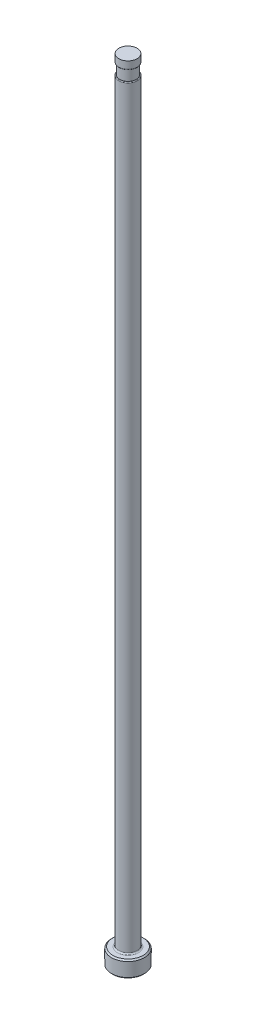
from build123d import *

# Parameters (mm, degrees)
CHAMFER1_SIZE     = 0.254
FILLET1_R         = 0.254
SKETCH2_W         = 0.2032
SKETCH2_H         = 2.032
D_SLOT_DEPTH      = 153.466131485
D_SLOT_DEPTH_BACK = 153.466131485
SKETCH5_W         = 0.0254
SKETCH5_H         = 1.524
FILLET2_R         = 0.127


with BuildPart() as part:
    # Sketch1 → Revolve1 (revolve)
    with BuildSketch(Plane.XY, mode=Mode.PRIVATE) as revolve1_sk:
        Polygon((0, 0), (-3.175, 0), (-3.175, 3.175), (-1.78562, 3.175), (-1.78562, 152.4), (0, 152.4), align=None)
    revolve(revolve1_sk.sketch.rotate(Axis((0, 259.958771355, 0), (0, -1, 0)), 270), axis=Axis((0, 259.958771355, 0), (0, -1, 0)))

    # Chamfer1
    chamfer1_edges = [part.edges().sort_by_distance(p)[0] for p in [
        (0, 3.175, -3.175),
        (0, 0, -3.175),
    ]]
    chamfer(chamfer1_edges, length=CHAMFER1_SIZE)

    # Fillet1
    fillet1_edges = [part.edges().sort_by_distance(p)[0] for p in [
        (0, 3.175, -1.78562),
    ]]
    fillet(fillet1_edges, radius=FILLET1_R)

    # Sketch2 → Vent Relief (revolve, cut)
    with BuildSketch(Plane.XY, mode=Mode.PRIVATE) as vent_relief_sk:
        with Locations((-1.68402, 149.86)):
            Rectangle(SKETCH2_W, SKETCH2_H)
    revolve(vent_relief_sk.sketch.rotate(Axis((0, 153.448281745, 0), (0, -1, 0)), 270), axis=Axis((0, 153.448281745, 0), (0, -1, 0)), mode=Mode.SUBTRACT)

    # Sketch3 → D-Slot (cut, two sides: drawn at the far end of the back side and taken through both)
    with BuildSketch(Plane.XY.offset(-D_SLOT_DEPTH_BACK)):
        with BuildLine():
            Line((-1.58242, 149.86), (-1.58242, 86.36))
            ThreePointArc((-1.58242, 86.36), (-1.633633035, 85.792038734), (-1.78562, 85.2424))
            Line((-1.78562, 85.2424), (-1.78562, 149.86))
            Line((-1.78562, 149.86), (-1.58242, 149.86))
        make_face()
    extrude(amount=D_SLOT_DEPTH + D_SLOT_DEPTH_BACK, mode=Mode.SUBTRACT)

    # Sketch5 → Vent Diameter (revolve, cut)
    with BuildSketch(Plane.XY, mode=Mode.PRIVATE) as vent_diameter_sk:
        with Locations((-1.77292, 151.638)):
            Rectangle(SKETCH5_W, SKETCH5_H)
    revolve(vent_diameter_sk.sketch.rotate(Axis((0, 152.687735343, 0), (0, -1, 0)), 90), axis=Axis((0, 152.687735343, 0), (0, -1, 0)), mode=Mode.SUBTRACT)

    # Fillet2
    fillet2_edges = [part.edges().sort_by_distance(p)[0] for p in [
        (1.527357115, 148.844, -0.924996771),
        (0, 150.876, 1.76022),
    ]]
    fillet(fillet2_edges, radius=FILLET2_R)


solid = part.part
